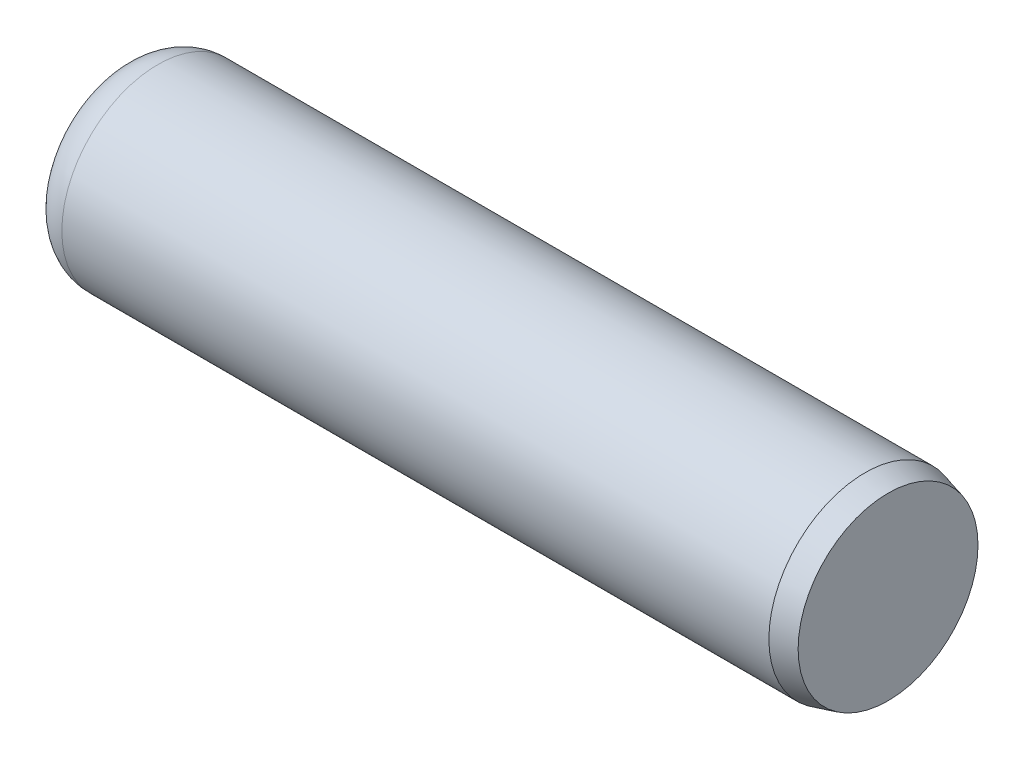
ISO-10303-21;
HEADER;
FILE_DESCRIPTION(('STEP AP214'),'2;1');
FILE_NAME('part.step','',(''),(''),'','','');
FILE_SCHEMA(('AUTOMOTIVE_DESIGN { 1 0 10303 214 1 1 1 1 }'));
ENDSEC;
DATA;
#1=APPLICATION_CONTEXT('core data for automotive mechanical design processes');
#2=APPLICATION_PROTOCOL_DEFINITION('international standard','automotive_design',2000,#1);
#3=PRODUCT_CONTEXT('',#1,'mechanical');
#4=PRODUCT('Part','Part','',(#3));
#5=PRODUCT_RELATED_PRODUCT_CATEGORY('part','',(#4));
#6=PRODUCT_DEFINITION_FORMATION('','',#4);
#7=PRODUCT_DEFINITION_CONTEXT('part definition',#1,'design');
#8=PRODUCT_DEFINITION('design','',#6,#7);
#9=PRODUCT_DEFINITION_SHAPE('','',#8);
#10=(LENGTH_UNIT() NAMED_UNIT(*) SI_UNIT(.MILLI.,.METRE.));
#11=(NAMED_UNIT(*) PLANE_ANGLE_UNIT() SI_UNIT($,.RADIAN.));
#12=(NAMED_UNIT(*) SI_UNIT($,.STERADIAN.) SOLID_ANGLE_UNIT());
#13=UNCERTAINTY_MEASURE_WITH_UNIT(LENGTH_MEASURE(1.E-05),#10,'distance_accuracy_value','');
#14=(GEOMETRIC_REPRESENTATION_CONTEXT(3) GLOBAL_UNCERTAINTY_ASSIGNED_CONTEXT((#13)) GLOBAL_UNIT_ASSIGNED_CONTEXT((#10,
#11,#12)) REPRESENTATION_CONTEXT('',''));
#15=CARTESIAN_POINT('',(0.,0.,0.));
#16=DIRECTION('',(0.,0.,1.));
#17=DIRECTION('',(1.,0.,0.));
#18=AXIS2_PLACEMENT_3D('',#15,#16,#17);
#19=CARTESIAN_POINT('',(0.,0.714755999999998,0.));
#20=DIRECTION('',(1.,0.,0.));
#21=DIRECTION('',(0.,0.,-1.));
#22=AXIS2_PLACEMENT_3D('',#19,#20,#21);
#23=PLANE('',#22);
#24=CARTESIAN_POINT('',(0.,0.,0.));
#25=DIRECTION('',(-1.,0.,0.));
#26=DIRECTION('',(0.,0.,1.));
#27=AXIS2_PLACEMENT_3D('',#24,#25,#26);
#28=CIRCLE('',#27,0.714755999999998);
#29=CARTESIAN_POINT('',(0.,0.,0.714755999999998));
#30=VERTEX_POINT('',#29);
#31=EDGE_CURVE('E52',#30,#30,#28,.T.);
#32=ORIENTED_EDGE('',*,*,#31,.T.);
#33=EDGE_LOOP('',(#32));
#34=FACE_BOUND('',#33,.T.);
#35=ADVANCED_FACE('F36',(#34),#23,.F.);
#36=CARTESIAN_POINT('',(9.525,0.,0.));
#37=DIRECTION('',(-1.,0.,0.));
#38=DIRECTION('',(0.,0.,1.));
#39=AXIS2_PLACEMENT_3D('',#36,#37,#38);
#40=PLANE('',#39);
#41=CARTESIAN_POINT('',(9.525,0.,0.));
#42=DIRECTION('',(-1.,0.,0.));
#43=DIRECTION('',(0.,0.,1.));
#44=AXIS2_PLACEMENT_3D('',#41,#42,#43);
#45=CIRCLE('',#44,1.11465268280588);
#46=CARTESIAN_POINT('',(9.525,0.,1.11465268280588));
#47=VERTEX_POINT('',#46);
#48=EDGE_CURVE('E10',#47,#47,#45,.T.);
#49=ORIENTED_EDGE('',*,*,#48,.F.);
#50=EDGE_LOOP('',(#49));
#51=FACE_BOUND('',#50,.T.);
#52=ADVANCED_FACE('F72',(#51),#40,.F.);
#53=CARTESIAN_POINT('',(9.525,0.,0.));
#54=DIRECTION('',(-1.,0.,0.));
#55=DIRECTION('',(0.,0.,1.));
#56=AXIS2_PLACEMENT_3D('',#53,#54,#55);
#57=CONICAL_SURFACE('',#56,1.11465268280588,0.26179938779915);
#58=CARTESIAN_POINT('',(9.2390976,0.,0.));
#59=DIRECTION('',(-1.,0.,0.));
#60=DIRECTION('',(0.,0.,1.));
#61=AXIS2_PLACEMENT_3D('',#58,#59,#60);
#62=CIRCLE('',#61,1.19126);
#63=CARTESIAN_POINT('',(9.2390976,0.,1.19126));
#64=VERTEX_POINT('',#63);
#65=EDGE_CURVE('E43',#64,#64,#62,.T.);
#66=ORIENTED_EDGE('',*,*,#65,.F.);
#67=EDGE_LOOP('',(#66));
#68=FACE_BOUND('',#67,.T.);
#69=ORIENTED_EDGE('',*,*,#48,.T.);
#70=EDGE_LOOP('',(#69));
#71=FACE_BOUND('',#70,.T.);
#72=ADVANCED_FACE('F67',(#68,#71),#57,.T.);
#73=CARTESIAN_POINT('',(-6.35,0.,0.));
#74=DIRECTION('',(-1.,0.,0.));
#75=DIRECTION('',(0.,0.,1.));
#76=AXIS2_PLACEMENT_3D('',#73,#74,#75);
#77=CYLINDRICAL_SURFACE('',#76,1.19126);
#78=CARTESIAN_POINT('',(0.476504,0.,0.));
#79=DIRECTION('',(-1.,0.,0.));
#80=DIRECTION('',(0.,0.,1.));
#81=AXIS2_PLACEMENT_3D('',#78,#79,#80);
#82=CIRCLE('',#81,1.19126);
#83=CARTESIAN_POINT('',(0.476504,0.,1.19126));
#84=VERTEX_POINT('',#83);
#85=EDGE_CURVE('E48',#84,#84,#82,.T.);
#86=ORIENTED_EDGE('',*,*,#85,.F.);
#87=EDGE_LOOP('',(#86));
#88=FACE_BOUND('',#87,.T.);
#89=ORIENTED_EDGE('',*,*,#65,.T.);
#90=EDGE_LOOP('',(#89));
#91=FACE_BOUND('',#90,.T.);
#92=ADVANCED_FACE('F62',(#88,#91),#77,.T.);
#93=CARTESIAN_POINT('',(0.476504,0.,0.));
#94=DIRECTION('',(-1.,0.,0.));
#95=DIRECTION('',(0.,0.,1.));
#96=AXIS2_PLACEMENT_3D('',#93,#94,#95);
#97=TOROIDAL_SURFACE('',#96,0.714755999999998,0.476504);
#98=ORIENTED_EDGE('',*,*,#31,.F.);
#99=EDGE_LOOP('',(#98));
#100=FACE_BOUND('',#99,.T.);
#101=ORIENTED_EDGE('',*,*,#85,.T.);
#102=EDGE_LOOP('',(#101));
#103=FACE_BOUND('',#102,.T.);
#104=ADVANCED_FACE('F59',(#100,#103),#97,.T.);
#105=CLOSED_SHELL('',(#35,#52,#72,#92,#104));
#106=MANIFOLD_SOLID_BREP('B2',#105);
#107=ADVANCED_BREP_SHAPE_REPRESENTATION('',(#18,#106),#14);
#108=SHAPE_DEFINITION_REPRESENTATION(#9,#107);
ENDSEC;
END-ISO-10303-21;
